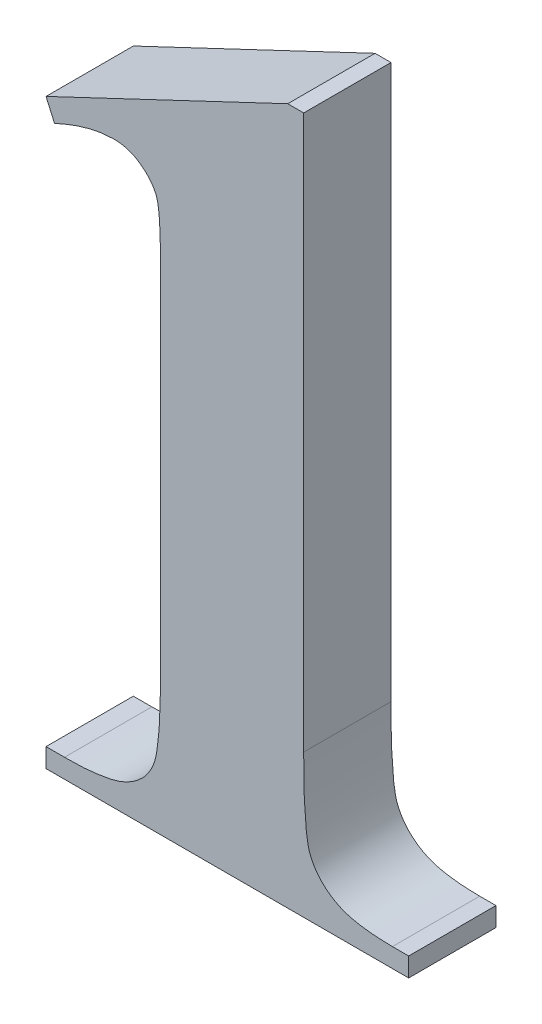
ISO-10303-21;
HEADER;
FILE_DESCRIPTION(('STEP AP214'),'2;1');
FILE_NAME('part.step','',(''),(''),'','','');
FILE_SCHEMA(('AUTOMOTIVE_DESIGN { 1 0 10303 214 1 1 1 1 }'));
ENDSEC;
DATA;
#1=APPLICATION_CONTEXT('core data for automotive mechanical design processes');
#2=APPLICATION_PROTOCOL_DEFINITION('international standard','automotive_design',2000,#1);
#3=PRODUCT_CONTEXT('',#1,'mechanical');
#4=PRODUCT('Part','Part','',(#3));
#5=PRODUCT_RELATED_PRODUCT_CATEGORY('part','',(#4));
#6=PRODUCT_DEFINITION_FORMATION('','',#4);
#7=PRODUCT_DEFINITION_CONTEXT('part definition',#1,'design');
#8=PRODUCT_DEFINITION('design','',#6,#7);
#9=PRODUCT_DEFINITION_SHAPE('','',#8);
#10=(LENGTH_UNIT() NAMED_UNIT(*) SI_UNIT(.MILLI.,.METRE.));
#11=(NAMED_UNIT(*) PLANE_ANGLE_UNIT() SI_UNIT($,.RADIAN.));
#12=(NAMED_UNIT(*) SI_UNIT($,.STERADIAN.) SOLID_ANGLE_UNIT());
#13=UNCERTAINTY_MEASURE_WITH_UNIT(LENGTH_MEASURE(1.E-05),#10,'distance_accuracy_value','');
#14=(GEOMETRIC_REPRESENTATION_CONTEXT(3) GLOBAL_UNCERTAINTY_ASSIGNED_CONTEXT((#13)) GLOBAL_UNIT_ASSIGNED_CONTEXT((#10,
#11,#12)) REPRESENTATION_CONTEXT('',''));
#15=CARTESIAN_POINT('',(0.,0.,0.));
#16=DIRECTION('',(0.,0.,1.));
#17=DIRECTION('',(1.,0.,0.));
#18=AXIS2_PLACEMENT_3D('',#15,#16,#17);
#19=CARTESIAN_POINT('',(-28.575,0.,-6.35));
#20=DIRECTION('',(0.,-1.,0.));
#21=DIRECTION('',(0.,0.,-1.));
#22=AXIS2_PLACEMENT_3D('',#19,#20,#21);
#23=PLANE('',#22);
#24=DIRECTION('',(0.,0.,1.));
#25=VECTOR('',#24,1.);
#26=CARTESIAN_POINT('',(3.3538207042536,0.,-6.35));
#27=LINE('',#26,#25);
#28=CARTESIAN_POINT('',(3.3538207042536,0.,-6.35));
#29=VERTEX_POINT('',#28);
#30=CARTESIAN_POINT('',(3.3538207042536,0.,0.));
#31=VERTEX_POINT('',#30);
#32=EDGE_CURVE('E285',#29,#31,#27,.T.);
#33=ORIENTED_EDGE('',*,*,#32,.T.);
#34=DIRECTION('',(1.,0.,0.));
#35=VECTOR('',#34,1.);
#36=CARTESIAN_POINT('',(-28.575,0.,0.));
#37=LINE('',#36,#35);
#38=CARTESIAN_POINT('',(-23.0221616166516,0.,0.));
#39=VERTEX_POINT('',#38);
#40=EDGE_CURVE('E36',#39,#31,#37,.T.);
#41=ORIENTED_EDGE('',*,*,#40,.F.);
#42=DIRECTION('',(0.,0.,1.));
#43=VECTOR('',#42,1.);
#44=CARTESIAN_POINT('',(-23.0221616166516,0.,-6.35));
#45=LINE('',#44,#43);
#46=CARTESIAN_POINT('',(-23.0221616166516,0.,-6.35));
#47=VERTEX_POINT('',#46);
#48=EDGE_CURVE('E290',#47,#39,#45,.T.);
#49=ORIENTED_EDGE('',*,*,#48,.F.);
#50=DIRECTION('',(1.,0.,0.));
#51=VECTOR('',#50,1.);
#52=CARTESIAN_POINT('',(-28.575,0.,-6.35));
#53=LINE('',#52,#51);
#54=EDGE_CURVE('E11',#47,#29,#53,.T.);
#55=ORIENTED_EDGE('',*,*,#54,.T.);
#56=EDGE_LOOP('',(#33,#41,#49,#55));
#57=FACE_BOUND('',#56,.T.);
#58=ADVANCED_FACE('F29',(#57),#23,.T.);
#59=CARTESIAN_POINT('',(-28.575,57.15,-6.35));
#60=DIRECTION('',(0.,0.,1.));
#61=DIRECTION('',(1.,0.,0.));
#62=AXIS2_PLACEMENT_3D('',#59,#60,#61);
#63=PLANE('',#62);
#64=DIRECTION('',(1.,0.,0.));
#65=VECTOR('',#64,1.);
#66=CARTESIAN_POINT('',(2.17167347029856,1.38820959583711,-6.35));
#67=LINE('',#66,#65);
#68=CARTESIAN_POINT('',(2.17167347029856,1.38820959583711,-6.35));
#69=VERTEX_POINT('',#68);
#70=CARTESIAN_POINT('',(3.3538207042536,1.38820959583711,-6.35));
#71=VERTEX_POINT('',#70);
#72=EDGE_CURVE('E212',#69,#71,#67,.T.);
#73=ORIENTED_EDGE('',*,*,#72,.T.);
#74=DIRECTION('',(0.,-1.,0.));
#75=VECTOR('',#74,1.);
#76=CARTESIAN_POINT('',(3.3538207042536,1.38820959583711,-6.35));
#77=LINE('',#76,#75);
#78=EDGE_CURVE('E242',#71,#29,#77,.T.);
#79=ORIENTED_EDGE('',*,*,#78,.T.);
#80=ORIENTED_EDGE('',*,*,#54,.F.);
#81=DIRECTION('',(0.,1.,0.));
#82=VECTOR('',#81,1.);
#83=CARTESIAN_POINT('',(-23.0221616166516,0.,-6.35));
#84=LINE('',#83,#82);
#85=CARTESIAN_POINT('',(-23.0221616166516,1.38820959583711,-6.35));
#86=VERTEX_POINT('',#85);
#87=EDGE_CURVE('E245',#47,#86,#84,.T.);
#88=ORIENTED_EDGE('',*,*,#87,.T.);
#89=DIRECTION('',(1.,0.,0.));
#90=VECTOR('',#89,1.);
#91=CARTESIAN_POINT('',(-23.0221616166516,1.38820959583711,-6.35));
#92=LINE('',#91,#90);
#93=CARTESIAN_POINT('',(-21.6773335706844,1.38820959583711,-6.35));
#94=VERTEX_POINT('',#93);
#95=EDGE_CURVE('E247',#86,#94,#92,.T.);
#96=ORIENTED_EDGE('',*,*,#95,.T.);
#97=CARTESIAN_POINT('',(-21.6773335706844,1.38820959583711,-6.35));
#98=CARTESIAN_POINT('',(-21.174124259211,1.39213155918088,-6.35));
#99=CARTESIAN_POINT('',(-20.2409119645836,1.39940492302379,-6.35));
#100=CARTESIAN_POINT('',(-18.9621538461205,1.55961835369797,-6.35));
#101=CARTESIAN_POINT('',(-17.9025008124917,1.75993248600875,-6.35));
#102=CARTESIAN_POINT('',(-17.0682399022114,2.10600013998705,-6.35));
#103=CARTESIAN_POINT('',(-16.4150112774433,2.53919750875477,-6.35));
#104=CARTESIAN_POINT('',(-15.8745865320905,3.02035826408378,-6.35));
#105=CARTESIAN_POINT('',(-15.4660659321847,3.59560183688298,-6.35));
#106=CARTESIAN_POINT('',(-15.2010731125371,4.13396074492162,-6.35));
#107=CARTESIAN_POINT('',(-15.0456605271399,4.65065455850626,-6.35));
#108=CARTESIAN_POINT('',(-14.9519919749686,5.15232418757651,-6.35));
#109=CARTESIAN_POINT('',(-14.8846415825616,5.76212193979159,-6.35));
#110=CARTESIAN_POINT('',(-14.8021059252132,6.47677136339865,-6.35));
#111=CARTESIAN_POINT('',(-14.7517006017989,7.30559527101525,-6.35));
#112=CARTESIAN_POINT('',(-14.7231253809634,8.24232639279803,-6.35));
#113=CARTESIAN_POINT('',(-14.7004442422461,9.29078479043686,-6.35));
#114=CARTESIAN_POINT('',(-14.695506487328,10.0247403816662,-6.35));
#115=CARTESIAN_POINT('',(-14.6929040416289,10.4115719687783,-6.35));
#116=B_SPLINE_CURVE_WITH_KNOTS('',3,(#97,#98,#99,#100,#101,#102,#103,#104,#105,#106,#107,#108,
#109,#110,#111,#112,#113,#114,#115),.UNSPECIFIED.,.F.,.F.,(4,1,1,1,1,1,1,1,1,1,1,1,1,1,1,1,4),
(0.,0.109216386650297,0.202544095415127,0.279725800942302,0.342739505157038,0.397199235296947,
0.449450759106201,0.498937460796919,0.549521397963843,0.579086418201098,0.615900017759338,
0.660224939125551,0.712352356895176,0.772172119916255,0.840542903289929,0.915958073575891,1.),.UNSPECIFIED.);
#117=CARTESIAN_POINT('',(-14.6929040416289,10.4115719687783,-6.35));
#118=VERTEX_POINT('',#117);
#119=EDGE_CURVE('E252',#94,#118,#116,.T.);
#120=ORIENTED_EDGE('',*,*,#119,.T.);
#121=DIRECTION('',(0.,1.,0.));
#122=VECTOR('',#121,1.);
#123=CARTESIAN_POINT('',(-14.6929040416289,10.4115719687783,-6.35));
#124=LINE('',#123,#122);
#125=CARTESIAN_POINT('',(-14.6929040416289,36.0934494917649,-6.35));
#126=VERTEX_POINT('',#125);
#127=EDGE_CURVE('E258',#118,#126,#124,.T.);
#128=ORIENTED_EDGE('',*,*,#127,.T.);
#129=CARTESIAN_POINT('',(-14.6929040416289,36.0934494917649,-6.35));
#130=CARTESIAN_POINT('',(-14.6971223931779,36.5815345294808,-6.35));
#131=CARTESIAN_POINT('',(-14.7046562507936,37.4532407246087,-6.35));
#132=CARTESIAN_POINT('',(-14.7529990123,38.6118409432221,-6.35));
#133=CARTESIAN_POINT('',(-14.8353100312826,39.4696431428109,-6.35));
#134=CARTESIAN_POINT('',(-15.0056237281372,40.2234976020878,-6.35));
#135=CARTESIAN_POINT('',(-15.4389139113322,40.9228478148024,-6.35));
#136=CARTESIAN_POINT('',(-16.0359112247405,41.438071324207,-6.35));
#137=CARTESIAN_POINT('',(-16.5925048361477,41.8057496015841,-6.35));
#138=CARTESIAN_POINT('',(-17.0772075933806,41.9785609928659,-6.35));
#139=CARTESIAN_POINT('',(-17.5813868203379,42.1125358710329,-6.35));
#140=CARTESIAN_POINT('',(-17.9310924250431,42.1197902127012,-6.35));
#141=CARTESIAN_POINT('',(-18.1092010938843,42.1234849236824,-6.35));
#142=B_SPLINE_CURVE_WITH_KNOTS('',3,(#129,#130,#131,#132,#133,#134,#135,#136,#137,#138,#139,
#140,#141),.UNSPECIFIED.,.F.,.F.,(4,1,1,1,1,1,1,1,1,1,4),(0.,0.18407895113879,0.328759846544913,
0.437165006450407,0.508921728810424,0.6183508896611,0.739961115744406,0.804272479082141,
0.868583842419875,0.933068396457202,1.),.UNSPECIFIED.);
#143=CARTESIAN_POINT('',(-18.1092010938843,42.1234849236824,-6.35));
#144=VERTEX_POINT('',#143);
#145=EDGE_CURVE('E325',#126,#144,#142,.T.);
#146=ORIENTED_EDGE('',*,*,#145,.T.);
#147=CARTESIAN_POINT('',(-18.1092010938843,42.1234849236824,-6.35));
#148=CARTESIAN_POINT('',(-18.4211594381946,42.1065406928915,-6.35));
#149=CARTESIAN_POINT('',(-19.0805789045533,42.0707238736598,-6.35));
#150=CARTESIAN_POINT('',(-20.1129169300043,41.8340954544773,-6.35));
#151=CARTESIAN_POINT('',(-21.2373298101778,41.4653934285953,-6.35));
#152=CARTESIAN_POINT('',(-22.0017984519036,41.1291014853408,-6.35));
#153=CARTESIAN_POINT('',(-22.4039745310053,40.9521830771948,-6.35));
#154=B_SPLINE_CURVE_WITH_KNOTS('',3,(#147,#148,#149,#150,#151,#152,#153),.UNSPECIFIED.,.F.,.F.,
(4,1,1,1,4),(0.,0.20878607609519,0.441333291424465,0.706093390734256,1.),.UNSPECIFIED.);
#155=CARTESIAN_POINT('',(-22.4039745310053,40.9521830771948,-6.35));
#156=VERTEX_POINT('',#155);
#157=EDGE_CURVE('E320',#144,#156,#154,.T.);
#158=ORIENTED_EDGE('',*,*,#157,.T.);
#159=DIRECTION('',(-0.406800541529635,0.913517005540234,0.));
#160=VECTOR('',#159,1.);
#161=CARTESIAN_POINT('',(-22.4039745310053,40.9521830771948,-6.35));
#162=LINE('',#161,#160);
#163=CARTESIAN_POINT('',(-23.0221616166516,42.340392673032,-6.35));
#164=VERTEX_POINT('',#163);
#165=EDGE_CURVE('E317',#156,#164,#162,.T.);
#166=ORIENTED_EDGE('',*,*,#165,.T.);
#167=DIRECTION('',(0.903703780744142,0.428158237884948,0.));
#168=VECTOR('',#167,1.);
#169=CARTESIAN_POINT('',(-23.0221616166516,42.340392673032,-6.35));
#170=LINE('',#169,#168);
#171=CARTESIAN_POINT('',(-5.44178853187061,50.6696502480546,-6.35));
#172=VERTEX_POINT('',#171);
#173=EDGE_CURVE('E314',#164,#172,#170,.T.);
#174=ORIENTED_EDGE('',*,*,#173,.T.);
#175=DIRECTION('',(1.,0.,0.));
#176=VECTOR('',#175,1.);
#177=CARTESIAN_POINT('',(-5.44178853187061,50.6696502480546,-6.35));
#178=LINE('',#177,#176);
#179=CARTESIAN_POINT('',(-4.28133207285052,50.6696502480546,-6.35));
#180=VERTEX_POINT('',#179);
#181=EDGE_CURVE('E203',#172,#180,#178,.T.);
#182=ORIENTED_EDGE('',*,*,#181,.T.);
#183=DIRECTION('',(0.,-1.,0.));
#184=VECTOR('',#183,1.);
#185=CARTESIAN_POINT('',(-4.28133207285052,50.6696502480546,-6.35));
#186=LINE('',#185,#184);
#187=CARTESIAN_POINT('',(-4.28133207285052,10.4115719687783,-6.35));
#188=VERTEX_POINT('',#187);
#189=EDGE_CURVE('E135',#180,#188,#186,.T.);
#190=ORIENTED_EDGE('',*,*,#189,.T.);
#191=CARTESIAN_POINT('',(-4.28133207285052,10.4115719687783,-6.35));
#192=CARTESIAN_POINT('',(-4.27730750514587,10.0356027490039,-6.35));
#193=CARTESIAN_POINT('',(-4.26960661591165,9.31619695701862,-6.35));
#194=CARTESIAN_POINT('',(-4.26504998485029,8.29287834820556,-6.35));
#195=CARTESIAN_POINT('',(-4.23456879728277,7.37408519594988,-6.35));
#196=CARTESIAN_POINT('',(-4.175304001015,6.56486450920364,-6.35));
#197=CARTESIAN_POINT('',(-4.12463856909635,5.85936062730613,-6.35));
#198=CARTESIAN_POINT('',(-4.06541926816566,5.26092737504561,-6.35));
#199=CARTESIAN_POINT('',(-3.97846173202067,4.77245875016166,-6.35));
#200=CARTESIAN_POINT('',(-3.85561497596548,4.26525746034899,-6.35));
#201=CARTESIAN_POINT('',(-3.61319162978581,3.73108896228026,-6.35));
#202=CARTESIAN_POINT('',(-3.22913451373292,3.1546790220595,-6.35));
#203=CARTESIAN_POINT('',(-2.72159934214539,2.64523134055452,-6.35));
#204=CARTESIAN_POINT('',(-2.09711334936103,2.18380282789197,-6.35));
#205=CARTESIAN_POINT('',(-1.30321433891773,1.80726280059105,-6.35));
#206=CARTESIAN_POINT('',(-0.313589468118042,1.56209413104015,-6.35));
#207=CARTESIAN_POINT('',(0.865849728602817,1.41630024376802,-6.35));
#208=CARTESIAN_POINT('',(1.71567127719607,1.39801903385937,-6.35));
#209=CARTESIAN_POINT('',(2.17167347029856,1.38820959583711,-6.35));
#210=B_SPLINE_CURVE_WITH_KNOTS('',3,(#191,#192,#193,#194,#195,#196,#197,#198,#199,#200,#201,
#202,#203,#204,#205,#206,#207,#208,#209),.UNSPECIFIED.,.F.,.F.,(4,1,1,1,1,1,1,1,1,1,1,1,1,1,1,1,
4),(0.,0.0847252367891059,0.162119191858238,0.230591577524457,0.291824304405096,0.3449315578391,
0.390001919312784,0.427234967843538,0.456674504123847,0.507378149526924,0.558440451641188,
0.612014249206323,0.668553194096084,0.732681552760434,0.808560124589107,0.897276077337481,1.),.UNSPECIFIED.);
#211=EDGE_CURVE('E206',#188,#69,#210,.T.);
#212=ORIENTED_EDGE('',*,*,#211,.T.);
#213=EDGE_LOOP('',(#73,#79,#80,#88,#96,#120,#128,#146,#158,#166,#174,#182,#190,#212));
#214=FACE_BOUND('',#213,.T.);
#215=ADVANCED_FACE('F230',(#214),#63,.F.);
#216=CARTESIAN_POINT('',(-28.575,57.15,0.));
#217=DIRECTION('',(0.,0.,1.));
#218=DIRECTION('',(1.,0.,0.));
#219=AXIS2_PLACEMENT_3D('',#216,#217,#218);
#220=PLANE('',#219);
#221=DIRECTION('',(0.,-1.,0.));
#222=VECTOR('',#221,1.);
#223=CARTESIAN_POINT('',(3.3538207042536,1.38820959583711,0.));
#224=LINE('',#223,#222);
#225=CARTESIAN_POINT('',(3.3538207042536,1.38820959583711,0.));
#226=VERTEX_POINT('',#225);
#227=EDGE_CURVE('E165',#226,#31,#224,.T.);
#228=ORIENTED_EDGE('',*,*,#227,.F.);
#229=DIRECTION('',(1.,0.,0.));
#230=VECTOR('',#229,1.);
#231=CARTESIAN_POINT('',(2.17167347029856,1.38820959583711,0.));
#232=LINE('',#231,#230);
#233=CARTESIAN_POINT('',(2.17167347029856,1.38820959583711,0.));
#234=VERTEX_POINT('',#233);
#235=EDGE_CURVE('E155',#234,#226,#232,.T.);
#236=ORIENTED_EDGE('',*,*,#235,.F.);
#237=CARTESIAN_POINT('',(-4.28133207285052,10.4115719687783,0.));
#238=CARTESIAN_POINT('',(-4.27730750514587,10.0356027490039,0.));
#239=CARTESIAN_POINT('',(-4.26960661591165,9.31619695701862,0.));
#240=CARTESIAN_POINT('',(-4.26504998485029,8.29287834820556,0.));
#241=CARTESIAN_POINT('',(-4.23456879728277,7.37408519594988,0.));
#242=CARTESIAN_POINT('',(-4.175304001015,6.56486450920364,0.));
#243=CARTESIAN_POINT('',(-4.12463856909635,5.85936062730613,0.));
#244=CARTESIAN_POINT('',(-4.06541926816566,5.26092737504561,0.));
#245=CARTESIAN_POINT('',(-3.97846173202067,4.77245875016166,0.));
#246=CARTESIAN_POINT('',(-3.85561497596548,4.26525746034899,0.));
#247=CARTESIAN_POINT('',(-3.61319162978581,3.73108896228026,0.));
#248=CARTESIAN_POINT('',(-3.22913451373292,3.1546790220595,0.));
#249=CARTESIAN_POINT('',(-2.72159934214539,2.64523134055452,0.));
#250=CARTESIAN_POINT('',(-2.09711334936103,2.18380282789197,0.));
#251=CARTESIAN_POINT('',(-1.30321433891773,1.80726280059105,0.));
#252=CARTESIAN_POINT('',(-0.313589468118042,1.56209413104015,0.));
#253=CARTESIAN_POINT('',(0.865849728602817,1.41630024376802,0.));
#254=CARTESIAN_POINT('',(1.71567127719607,1.39801903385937,0.));
#255=CARTESIAN_POINT('',(2.17167347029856,1.38820959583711,0.));
#256=B_SPLINE_CURVE_WITH_KNOTS('',3,(#237,#238,#239,#240,#241,#242,#243,#244,#245,#246,#247,
#248,#249,#250,#251,#252,#253,#254,#255),.UNSPECIFIED.,.F.,.F.,(4,1,1,1,1,1,1,1,1,1,1,1,1,1,1,1,
4),(0.,0.0847252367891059,0.162119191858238,0.230591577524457,0.291824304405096,0.3449315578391,
0.390001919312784,0.427234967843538,0.456674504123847,0.507378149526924,0.558440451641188,
0.612014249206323,0.668553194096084,0.732681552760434,0.808560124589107,0.897276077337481,1.),.UNSPECIFIED.);
#257=CARTESIAN_POINT('',(-4.28133207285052,10.4115719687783,0.));
#258=VERTEX_POINT('',#257);
#259=EDGE_CURVE('E153',#258,#234,#256,.T.);
#260=ORIENTED_EDGE('',*,*,#259,.F.);
#261=DIRECTION('',(0.,-1.,0.));
#262=VECTOR('',#261,1.);
#263=CARTESIAN_POINT('',(-4.28133207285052,50.6696502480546,0.));
#264=LINE('',#263,#262);
#265=CARTESIAN_POINT('',(-4.28133207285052,50.6696502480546,0.));
#266=VERTEX_POINT('',#265);
#267=EDGE_CURVE('E132',#266,#258,#264,.T.);
#268=ORIENTED_EDGE('',*,*,#267,.F.);
#269=DIRECTION('',(1.,0.,0.));
#270=VECTOR('',#269,1.);
#271=CARTESIAN_POINT('',(-5.44178853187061,50.6696502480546,0.));
#272=LINE('',#271,#270);
#273=CARTESIAN_POINT('',(-5.44178853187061,50.6696502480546,0.));
#274=VERTEX_POINT('',#273);
#275=EDGE_CURVE('E142',#274,#266,#272,.T.);
#276=ORIENTED_EDGE('',*,*,#275,.F.);
#277=DIRECTION('',(0.903703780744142,0.428158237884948,0.));
#278=VECTOR('',#277,1.);
#279=CARTESIAN_POINT('',(-23.0221616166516,42.340392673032,0.));
#280=LINE('',#279,#278);
#281=CARTESIAN_POINT('',(-23.0221616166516,42.340392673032,0.));
#282=VERTEX_POINT('',#281);
#283=EDGE_CURVE('E201',#282,#274,#280,.T.);
#284=ORIENTED_EDGE('',*,*,#283,.F.);
#285=DIRECTION('',(-0.406800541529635,0.913517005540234,0.));
#286=VECTOR('',#285,1.);
#287=CARTESIAN_POINT('',(-22.4039745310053,40.9521830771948,0.));
#288=LINE('',#287,#286);
#289=CARTESIAN_POINT('',(-22.4039745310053,40.9521830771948,0.));
#290=VERTEX_POINT('',#289);
#291=EDGE_CURVE('E43',#290,#282,#288,.T.);
#292=ORIENTED_EDGE('',*,*,#291,.F.);
#293=CARTESIAN_POINT('',(-18.1092010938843,42.1234849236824,0.));
#294=CARTESIAN_POINT('',(-18.4211594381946,42.1065406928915,0.));
#295=CARTESIAN_POINT('',(-19.0805789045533,42.0707238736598,0.));
#296=CARTESIAN_POINT('',(-20.1129169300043,41.8340954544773,0.));
#297=CARTESIAN_POINT('',(-21.2373298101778,41.4653934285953,0.));
#298=CARTESIAN_POINT('',(-22.0017984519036,41.1291014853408,0.));
#299=CARTESIAN_POINT('',(-22.4039745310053,40.9521830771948,0.));
#300=B_SPLINE_CURVE_WITH_KNOTS('',3,(#293,#294,#295,#296,#297,#298,#299),.UNSPECIFIED.,.F.,.F.,
(4,1,1,1,4),(0.,0.20878607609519,0.441333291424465,0.706093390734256,1.),.UNSPECIFIED.);
#301=CARTESIAN_POINT('',(-18.1092010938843,42.1234849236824,0.));
#302=VERTEX_POINT('',#301);
#303=EDGE_CURVE('E189',#302,#290,#300,.T.);
#304=ORIENTED_EDGE('',*,*,#303,.F.);
#305=CARTESIAN_POINT('',(-14.6929040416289,36.0934494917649,0.));
#306=CARTESIAN_POINT('',(-14.6971223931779,36.5815345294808,0.));
#307=CARTESIAN_POINT('',(-14.7046562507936,37.4532407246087,0.));
#308=CARTESIAN_POINT('',(-14.7529990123,38.6118409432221,0.));
#309=CARTESIAN_POINT('',(-14.8353100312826,39.4696431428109,0.));
#310=CARTESIAN_POINT('',(-15.0056237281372,40.2234976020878,0.));
#311=CARTESIAN_POINT('',(-15.4389139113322,40.9228478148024,0.));
#312=CARTESIAN_POINT('',(-16.0359112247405,41.438071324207,0.));
#313=CARTESIAN_POINT('',(-16.5925048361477,41.8057496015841,0.));
#314=CARTESIAN_POINT('',(-17.0772075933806,41.9785609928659,0.));
#315=CARTESIAN_POINT('',(-17.5813868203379,42.1125358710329,0.));
#316=CARTESIAN_POINT('',(-17.9310924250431,42.1197902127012,0.));
#317=CARTESIAN_POINT('',(-18.1092010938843,42.1234849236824,0.));
#318=B_SPLINE_CURVE_WITH_KNOTS('',3,(#305,#306,#307,#308,#309,#310,#311,#312,#313,#314,#315,
#316,#317),.UNSPECIFIED.,.F.,.F.,(4,1,1,1,1,1,1,1,1,1,4),(0.,0.18407895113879,0.328759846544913,
0.437165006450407,0.508921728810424,0.6183508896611,0.739961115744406,0.804272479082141,
0.868583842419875,0.933068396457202,1.),.UNSPECIFIED.);
#319=CARTESIAN_POINT('',(-14.6929040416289,36.0934494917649,0.));
#320=VERTEX_POINT('',#319);
#321=EDGE_CURVE('E184',#320,#302,#318,.T.);
#322=ORIENTED_EDGE('',*,*,#321,.F.);
#323=DIRECTION('',(0.,1.,0.));
#324=VECTOR('',#323,1.);
#325=CARTESIAN_POINT('',(-14.6929040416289,10.4115719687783,0.));
#326=LINE('',#325,#324);
#327=CARTESIAN_POINT('',(-14.6929040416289,10.4115719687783,0.));
#328=VERTEX_POINT('',#327);
#329=EDGE_CURVE('E178',#328,#320,#326,.T.);
#330=ORIENTED_EDGE('',*,*,#329,.F.);
#331=CARTESIAN_POINT('',(-21.6773335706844,1.38820959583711,0.));
#332=CARTESIAN_POINT('',(-21.174124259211,1.39213155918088,0.));
#333=CARTESIAN_POINT('',(-20.2409119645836,1.39940492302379,0.));
#334=CARTESIAN_POINT('',(-18.9621538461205,1.55961835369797,0.));
#335=CARTESIAN_POINT('',(-17.9025008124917,1.75993248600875,0.));
#336=CARTESIAN_POINT('',(-17.0682399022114,2.10600013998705,0.));
#337=CARTESIAN_POINT('',(-16.4150112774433,2.53919750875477,0.));
#338=CARTESIAN_POINT('',(-15.8745865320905,3.02035826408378,0.));
#339=CARTESIAN_POINT('',(-15.4660659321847,3.59560183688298,0.));
#340=CARTESIAN_POINT('',(-15.2010731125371,4.13396074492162,0.));
#341=CARTESIAN_POINT('',(-15.0456605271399,4.65065455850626,0.));
#342=CARTESIAN_POINT('',(-14.9519919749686,5.15232418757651,0.));
#343=CARTESIAN_POINT('',(-14.8846415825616,5.76212193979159,0.));
#344=CARTESIAN_POINT('',(-14.8021059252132,6.47677136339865,0.));
#345=CARTESIAN_POINT('',(-14.7517006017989,7.30559527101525,0.));
#346=CARTESIAN_POINT('',(-14.7231253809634,8.24232639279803,0.));
#347=CARTESIAN_POINT('',(-14.7004442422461,9.29078479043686,0.));
#348=CARTESIAN_POINT('',(-14.695506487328,10.0247403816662,0.));
#349=CARTESIAN_POINT('',(-14.6929040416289,10.4115719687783,0.));
#350=B_SPLINE_CURVE_WITH_KNOTS('',3,(#331,#332,#333,#334,#335,#336,#337,#338,#339,#340,#341,
#342,#343,#344,#345,#346,#347,#348,#349),.UNSPECIFIED.,.F.,.F.,(4,1,1,1,1,1,1,1,1,1,1,1,1,1,1,1,
4),(0.,0.109216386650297,0.202544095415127,0.279725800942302,0.342739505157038,
0.397199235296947,0.449450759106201,0.498937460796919,0.549521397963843,0.579086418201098,
0.615900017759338,0.660224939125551,0.712352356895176,0.772172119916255,0.840542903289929,
0.915958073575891,1.),.UNSPECIFIED.);
#351=CARTESIAN_POINT('',(-21.6773335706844,1.38820959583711,0.));
#352=VERTEX_POINT('',#351);
#353=EDGE_CURVE('E173',#352,#328,#350,.T.);
#354=ORIENTED_EDGE('',*,*,#353,.F.);
#355=DIRECTION('',(1.,0.,0.));
#356=VECTOR('',#355,1.);
#357=CARTESIAN_POINT('',(-23.0221616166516,1.38820959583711,0.));
#358=LINE('',#357,#356);
#359=CARTESIAN_POINT('',(-23.0221616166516,1.38820959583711,0.));
#360=VERTEX_POINT('',#359);
#361=EDGE_CURVE('E170',#360,#352,#358,.T.);
#362=ORIENTED_EDGE('',*,*,#361,.F.);
#363=DIRECTION('',(0.,1.,0.));
#364=VECTOR('',#363,1.);
#365=CARTESIAN_POINT('',(-23.0221616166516,0.,0.));
#366=LINE('',#365,#364);
#367=EDGE_CURVE('E167',#39,#360,#366,.T.);
#368=ORIENTED_EDGE('',*,*,#367,.F.);
#369=ORIENTED_EDGE('',*,*,#40,.T.);
#370=EDGE_LOOP('',(#228,#236,#260,#268,#276,#284,#292,#304,#322,#330,#354,#362,#368,#369));
#371=FACE_BOUND('',#370,.T.);
#372=ADVANCED_FACE('F150',(#371),#220,.T.);
#373=CARTESIAN_POINT('',(-5.44178853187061,50.6696502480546,-6.35));
#374=DIRECTION('',(0.,-1.,0.));
#375=DIRECTION('',(0.,0.,-1.));
#376=AXIS2_PLACEMENT_3D('',#373,#374,#375);
#377=PLANE('',#376);
#378=ORIENTED_EDGE('',*,*,#275,.T.);
#379=DIRECTION('',(0.,0.,1.));
#380=VECTOR('',#379,1.);
#381=CARTESIAN_POINT('',(-4.28133207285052,50.6696502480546,-6.35));
#382=LINE('',#381,#380);
#383=EDGE_CURVE('E128',#180,#266,#382,.T.);
#384=ORIENTED_EDGE('',*,*,#383,.F.);
#385=ORIENTED_EDGE('',*,*,#181,.F.);
#386=DIRECTION('',(0.,0.,1.));
#387=VECTOR('',#386,1.);
#388=CARTESIAN_POINT('',(-5.44178853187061,50.6696502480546,-6.35));
#389=LINE('',#388,#387);
#390=EDGE_CURVE('E144',#172,#274,#389,.T.);
#391=ORIENTED_EDGE('',*,*,#390,.T.);
#392=EDGE_LOOP('',(#378,#384,#385,#391));
#393=FACE_BOUND('',#392,.T.);
#394=ADVANCED_FACE('F143',(#393),#377,.F.);
#395=CARTESIAN_POINT('',(-4.28133207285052,50.6696502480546,-6.35));
#396=DIRECTION('',(-1.,0.,0.));
#397=DIRECTION('',(0.,0.,1.));
#398=AXIS2_PLACEMENT_3D('',#395,#396,#397);
#399=PLANE('',#398);
#400=ORIENTED_EDGE('',*,*,#267,.T.);
#401=DIRECTION('',(0.,0.,1.));
#402=VECTOR('',#401,1.);
#403=CARTESIAN_POINT('',(-4.28133207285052,10.4115719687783,-6.35));
#404=LINE('',#403,#402);
#405=EDGE_CURVE('E139',#188,#258,#404,.T.);
#406=ORIENTED_EDGE('',*,*,#405,.F.);
#407=ORIENTED_EDGE('',*,*,#189,.F.);
#408=ORIENTED_EDGE('',*,*,#383,.T.);
#409=EDGE_LOOP('',(#400,#406,#407,#408));
#410=FACE_BOUND('',#409,.T.);
#411=ADVANCED_FACE('F130',(#410),#399,.F.);
#412=DIRECTION('',(0.,0.,1.));
#413=VECTOR('',#412,1.);
#414=SURFACE_OF_LINEAR_EXTRUSION('',#210,#413);
#415=ORIENTED_EDGE('',*,*,#259,.T.);
#416=DIRECTION('',(0.,0.,1.));
#417=VECTOR('',#416,1.);
#418=CARTESIAN_POINT('',(2.17167347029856,1.38820959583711,-6.35));
#419=LINE('',#418,#417);
#420=EDGE_CURVE('E296',#69,#234,#419,.T.);
#421=ORIENTED_EDGE('',*,*,#420,.F.);
#422=ORIENTED_EDGE('',*,*,#211,.F.);
#423=ORIENTED_EDGE('',*,*,#405,.T.);
#424=EDGE_LOOP('',(#415,#421,#422,#423));
#425=FACE_BOUND('',#424,.T.);
#426=ADVANCED_FACE('F218',(#425),#414,.F.);
#427=CARTESIAN_POINT('',(2.17167347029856,1.38820959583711,-6.35));
#428=DIRECTION('',(0.,-1.,0.));
#429=DIRECTION('',(0.,0.,-1.));
#430=AXIS2_PLACEMENT_3D('',#427,#428,#429);
#431=PLANE('',#430);
#432=ORIENTED_EDGE('',*,*,#235,.T.);
#433=DIRECTION('',(0.,0.,1.));
#434=VECTOR('',#433,1.);
#435=CARTESIAN_POINT('',(3.3538207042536,1.38820959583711,-6.35));
#436=LINE('',#435,#434);
#437=EDGE_CURVE('E286',#71,#226,#436,.T.);
#438=ORIENTED_EDGE('',*,*,#437,.F.);
#439=ORIENTED_EDGE('',*,*,#72,.F.);
#440=ORIENTED_EDGE('',*,*,#420,.T.);
#441=EDGE_LOOP('',(#432,#438,#439,#440));
#442=FACE_BOUND('',#441,.T.);
#443=ADVANCED_FACE('F222',(#442),#431,.F.);
#444=CARTESIAN_POINT('',(3.3538207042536,1.38820959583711,-6.35));
#445=DIRECTION('',(-1.,0.,0.));
#446=DIRECTION('',(0.,0.,1.));
#447=AXIS2_PLACEMENT_3D('',#444,#445,#446);
#448=PLANE('',#447);
#449=ORIENTED_EDGE('',*,*,#227,.T.);
#450=ORIENTED_EDGE('',*,*,#32,.F.);
#451=ORIENTED_EDGE('',*,*,#78,.F.);
#452=ORIENTED_EDGE('',*,*,#437,.T.);
#453=EDGE_LOOP('',(#449,#450,#451,#452));
#454=FACE_BOUND('',#453,.T.);
#455=ADVANCED_FACE('F277',(#454),#448,.F.);
#456=CARTESIAN_POINT('',(-23.0221616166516,0.,-6.35));
#457=DIRECTION('',(1.,0.,0.));
#458=DIRECTION('',(0.,0.,-1.));
#459=AXIS2_PLACEMENT_3D('',#456,#457,#458);
#460=PLANE('',#459);
#461=ORIENTED_EDGE('',*,*,#367,.T.);
#462=DIRECTION('',(0.,0.,1.));
#463=VECTOR('',#462,1.);
#464=CARTESIAN_POINT('',(-23.0221616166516,1.38820959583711,-6.35));
#465=LINE('',#464,#463);
#466=EDGE_CURVE('E300',#86,#360,#465,.T.);
#467=ORIENTED_EDGE('',*,*,#466,.F.);
#468=ORIENTED_EDGE('',*,*,#87,.F.);
#469=ORIENTED_EDGE('',*,*,#48,.T.);
#470=EDGE_LOOP('',(#461,#467,#468,#469));
#471=FACE_BOUND('',#470,.T.);
#472=ADVANCED_FACE('F274',(#471),#460,.F.);
#473=CARTESIAN_POINT('',(-23.0221616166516,1.38820959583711,-6.35));
#474=DIRECTION('',(0.,-1.,0.));
#475=DIRECTION('',(0.,0.,-1.));
#476=AXIS2_PLACEMENT_3D('',#473,#474,#475);
#477=PLANE('',#476);
#478=ORIENTED_EDGE('',*,*,#361,.T.);
#479=DIRECTION('',(0.,0.,1.));
#480=VECTOR('',#479,1.);
#481=CARTESIAN_POINT('',(-21.6773335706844,1.38820959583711,-6.35));
#482=LINE('',#481,#480);
#483=EDGE_CURVE('E302',#94,#352,#482,.T.);
#484=ORIENTED_EDGE('',*,*,#483,.F.);
#485=ORIENTED_EDGE('',*,*,#95,.F.);
#486=ORIENTED_EDGE('',*,*,#466,.T.);
#487=EDGE_LOOP('',(#478,#484,#485,#486));
#488=FACE_BOUND('',#487,.T.);
#489=ADVANCED_FACE('F269',(#488),#477,.F.);
#490=DIRECTION('',(0.,0.,1.));
#491=VECTOR('',#490,1.);
#492=SURFACE_OF_LINEAR_EXTRUSION('',#116,#491);
#493=ORIENTED_EDGE('',*,*,#353,.T.);
#494=DIRECTION('',(0.,0.,1.));
#495=VECTOR('',#494,1.);
#496=CARTESIAN_POINT('',(-14.6929040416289,10.4115719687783,-6.35));
#497=LINE('',#496,#495);
#498=EDGE_CURVE('E304',#118,#328,#497,.T.);
#499=ORIENTED_EDGE('',*,*,#498,.F.);
#500=ORIENTED_EDGE('',*,*,#119,.F.);
#501=ORIENTED_EDGE('',*,*,#483,.T.);
#502=EDGE_LOOP('',(#493,#499,#500,#501));
#503=FACE_BOUND('',#502,.T.);
#504=ADVANCED_FACE('F264',(#503),#492,.F.);
#505=CARTESIAN_POINT('',(-14.6929040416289,10.4115719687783,-6.35));
#506=DIRECTION('',(1.,0.,0.));
#507=DIRECTION('',(0.,0.,-1.));
#508=AXIS2_PLACEMENT_3D('',#505,#506,#507);
#509=PLANE('',#508);
#510=ORIENTED_EDGE('',*,*,#329,.T.);
#511=DIRECTION('',(0.,0.,1.));
#512=VECTOR('',#511,1.);
#513=CARTESIAN_POINT('',(-14.6929040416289,36.0934494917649,-6.35));
#514=LINE('',#513,#512);
#515=EDGE_CURVE('E306',#126,#320,#514,.T.);
#516=ORIENTED_EDGE('',*,*,#515,.F.);
#517=ORIENTED_EDGE('',*,*,#127,.F.);
#518=ORIENTED_EDGE('',*,*,#498,.T.);
#519=EDGE_LOOP('',(#510,#516,#517,#518));
#520=FACE_BOUND('',#519,.T.);
#521=ADVANCED_FACE('F268',(#520),#509,.F.);
#522=DIRECTION('',(0.,0.,1.));
#523=VECTOR('',#522,1.);
#524=SURFACE_OF_LINEAR_EXTRUSION('',#142,#523);
#525=ORIENTED_EDGE('',*,*,#321,.T.);
#526=DIRECTION('',(0.,0.,1.));
#527=VECTOR('',#526,1.);
#528=CARTESIAN_POINT('',(-18.1092010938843,42.1234849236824,-6.35));
#529=LINE('',#528,#527);
#530=EDGE_CURVE('E308',#144,#302,#529,.T.);
#531=ORIENTED_EDGE('',*,*,#530,.F.);
#532=ORIENTED_EDGE('',*,*,#145,.F.);
#533=ORIENTED_EDGE('',*,*,#515,.T.);
#534=EDGE_LOOP('',(#525,#531,#532,#533));
#535=FACE_BOUND('',#534,.T.);
#536=ADVANCED_FACE('F337',(#535),#524,.F.);
#537=DIRECTION('',(0.,0.,1.));
#538=VECTOR('',#537,1.);
#539=SURFACE_OF_LINEAR_EXTRUSION('',#154,#538);
#540=ORIENTED_EDGE('',*,*,#303,.T.);
#541=DIRECTION('',(0.,0.,1.));
#542=VECTOR('',#541,1.);
#543=CARTESIAN_POINT('',(-22.4039745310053,40.9521830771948,-6.35));
#544=LINE('',#543,#542);
#545=EDGE_CURVE('E310',#156,#290,#544,.T.);
#546=ORIENTED_EDGE('',*,*,#545,.F.);
#547=ORIENTED_EDGE('',*,*,#157,.F.);
#548=ORIENTED_EDGE('',*,*,#530,.T.);
#549=EDGE_LOOP('',(#540,#546,#547,#548));
#550=FACE_BOUND('',#549,.T.);
#551=ADVANCED_FACE('F333',(#550),#539,.F.);
#552=CARTESIAN_POINT('',(-22.4039745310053,40.9521830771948,-6.35));
#553=DIRECTION('',(0.913517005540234,0.406800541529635,0.));
#554=DIRECTION('',(-0.406800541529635,0.913517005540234,0.));
#555=AXIS2_PLACEMENT_3D('',#552,#553,#554);
#556=PLANE('',#555);
#557=ORIENTED_EDGE('',*,*,#291,.T.);
#558=DIRECTION('',(0.,0.,1.));
#559=VECTOR('',#558,1.);
#560=CARTESIAN_POINT('',(-23.0221616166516,42.340392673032,-6.35));
#561=LINE('',#560,#559);
#562=EDGE_CURVE('E47',#164,#282,#561,.T.);
#563=ORIENTED_EDGE('',*,*,#562,.F.);
#564=ORIENTED_EDGE('',*,*,#165,.F.);
#565=ORIENTED_EDGE('',*,*,#545,.T.);
#566=EDGE_LOOP('',(#557,#563,#564,#565));
#567=FACE_BOUND('',#566,.T.);
#568=ADVANCED_FACE('F336',(#567),#556,.F.);
#569=CARTESIAN_POINT('',(-23.0221616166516,42.340392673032,-6.35));
#570=DIRECTION('',(0.428158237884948,-0.903703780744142,0.));
#571=DIRECTION('',(0.903703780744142,0.428158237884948,0.));
#572=AXIS2_PLACEMENT_3D('',#569,#570,#571);
#573=PLANE('',#572);
#574=ORIENTED_EDGE('',*,*,#283,.T.);
#575=ORIENTED_EDGE('',*,*,#390,.F.);
#576=ORIENTED_EDGE('',*,*,#173,.F.);
#577=ORIENTED_EDGE('',*,*,#562,.T.);
#578=EDGE_LOOP('',(#574,#575,#576,#577));
#579=FACE_BOUND('',#578,.T.);
#580=ADVANCED_FACE('F358',(#579),#573,.F.);
#581=CLOSED_SHELL('',(#58,#215,#372,#394,#411,#426,#443,#455,#472,#489,#504,#521,#536,#551,#568,#580));
#582=MANIFOLD_SOLID_BREP('B2',#581);
#583=ADVANCED_BREP_SHAPE_REPRESENTATION('',(#18,#582),#14);
#584=SHAPE_DEFINITION_REPRESENTATION(#9,#583);
ENDSEC;
END-ISO-10303-21;
